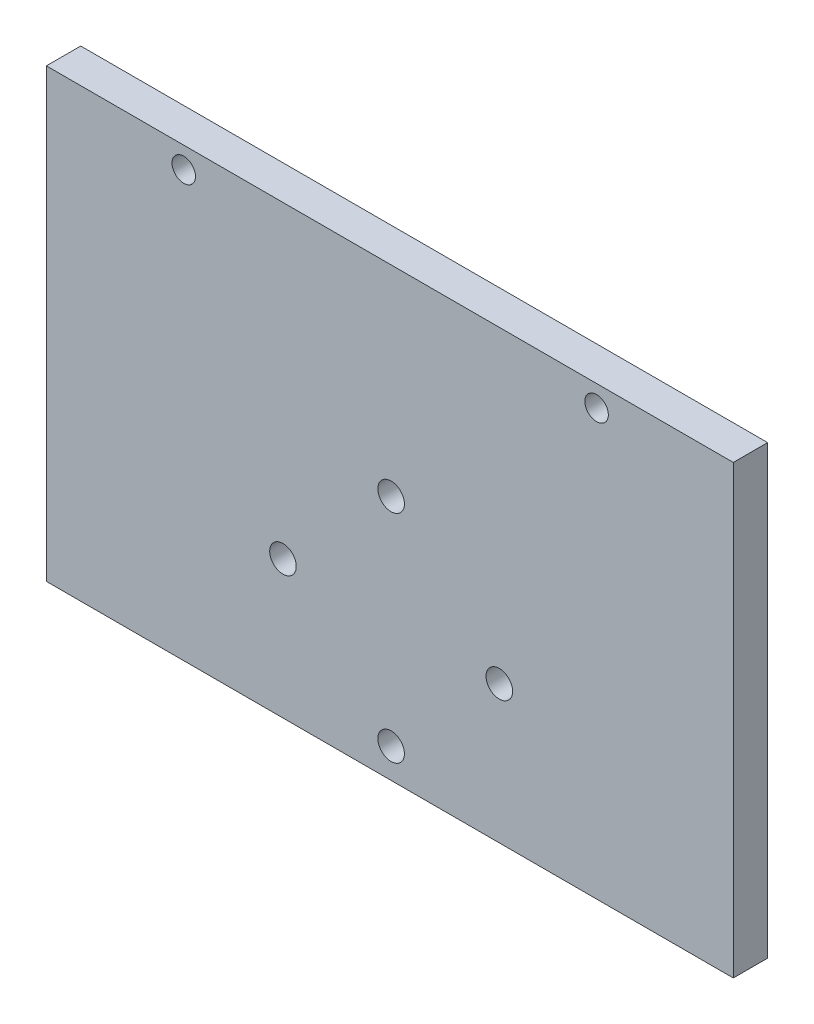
from build123d import *

# Parameters (mm, degrees)
SKETCH1_W                 = 127
SKETCH1_H                 = 82.55
BOSS_EXTRUDE1_DEPTH       = 6.35
F_8_CLEARANCE_HOLE1_D     = 4.9149
F_8_CLEARANCE_HOLE1_DEPTH = 8.89
F_8_CLEARANCE_HOLE1_TIP   = 1.476584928
SKETCH10_R                = 2.1717
CUT_EXTRUDE1_DEPTH        = 6.35


with BuildPart() as part:
    # Sketch1 → Boss-Extrude1 (new body)
    with BuildSketch(Plane.XY):
        Rectangle(SKETCH1_W, SKETCH1_H)
    extrude(amount=BOSS_EXTRUDE1_DEPTH)

    # 8 Clearance Hole1
    with Locations(Plane.XY.offset(6.35)):
        with Locations((20.243156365, -15.78892), (-19.756843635, -15.78892), (0.243156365, -35.78892), (0.243156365, 4.21108)):
            Hole(F_8_CLEARANCE_HOLE1_D / 2, depth=F_8_CLEARANCE_HOLE1_DEPTH)
            with Locations((0, 0, -(F_8_CLEARANCE_HOLE1_DEPTH + F_8_CLEARANCE_HOLE1_TIP / 2))):  # 118° drill point
                Cone(0, F_8_CLEARANCE_HOLE1_D / 2, F_8_CLEARANCE_HOLE1_TIP, mode=Mode.SUBTRACT)

    # Sketch10 → Cut-Extrude1 (cut)
    with BuildSketch(Plane.XY.offset(6.35)):
        with Locations((-38.1, 37.338)):
            Circle(SKETCH10_R)
        with Locations((38.226058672, 37.338)):
            Circle(SKETCH10_R)
    extrude(amount=-CUT_EXTRUDE1_DEPTH, mode=Mode.SUBTRACT)


solid = part.part
